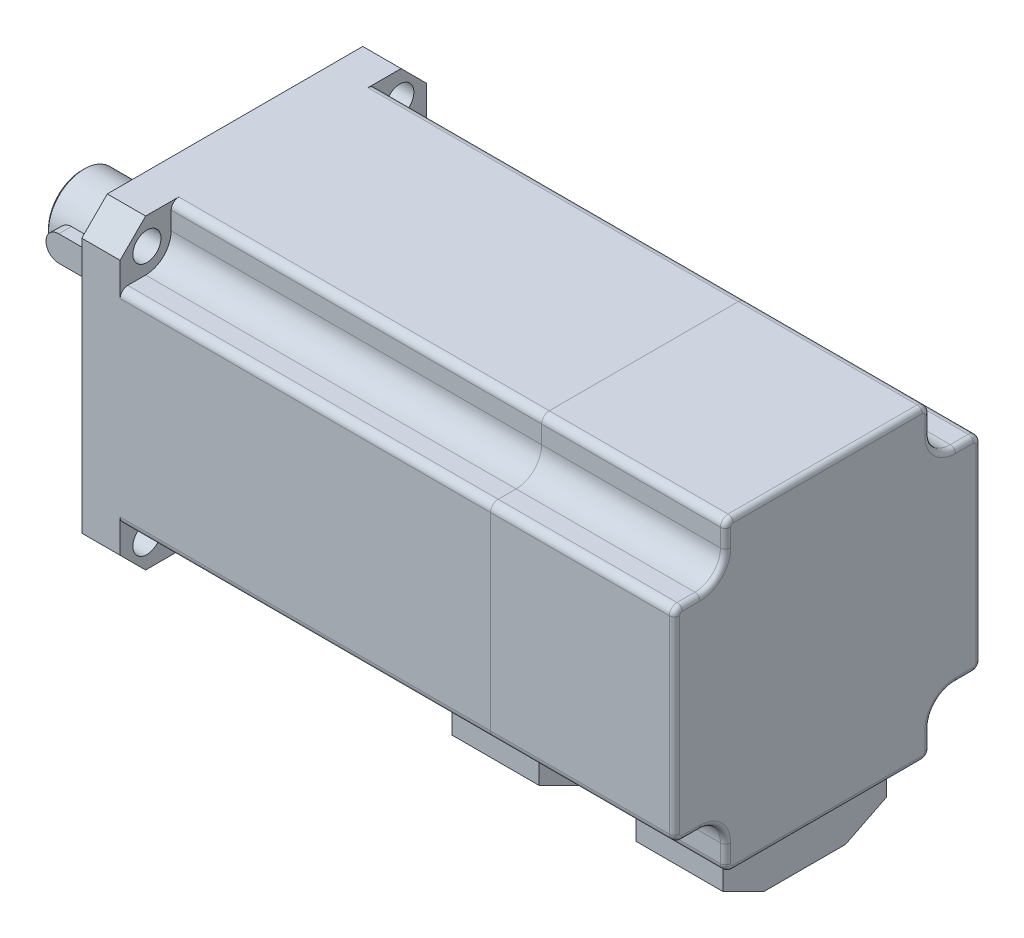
from build123d import *

# Parameters (mm, degrees)
EXTRUDE_1_DEPTH     = 80
EXTRUDE_2_DEPTH     = 36
CUT_EXTRUDE_1_DEPTH = 108.5
FILLET_1_R          = 1
SKETCH_4_R          = 2.75
CUT_EXTRUDE_2_DEPTH = 7.5
SKETCH_5_R          = 25
SKETCH_5_R_2        = 22.5
EXTRUDE_3_DEPTH     = 3
SKETCH_6_R          = 7.5
EXTRUDE_4_DEPTH     = 5
FILLET_2_R          = 0.5
SKETCH_7_R          = 7
EXTRUDE_5_DEPTH     = 25
CHAMFER_1_SIZE      = 0.5
CUT_EXTRUDE_3_DEPTH = 3
EXTRUDE_6_DEPTH     = 5
SKETCH_10_W         = 17
SKETCH_10_H         = 32
EXTRUDE_7_DEPTH     = 11
EXTRUDE_7_2_DEPTH   = 11
CUT_EXTRUDE_4_DEPTH = 53


with BuildPart() as part:
    # Sketch 1 → Extrude 1 (new body)
    with BuildSketch(Plane(origin=(0, 0, 0), x_dir=(0, 0, -1), z_dir=(1, 0, 0))):
        Polygon((-30, 25), (-25, 30), (25, 30), (30, 25), (30, -25), (25, -30), (-25, -30), (-30, -25), align=None)
    extrude(amount=EXTRUDE_1_DEPTH)


with BuildPart() as body_2:
    # Sketch 2 → Extrude 2 (new body)
    with BuildSketch(Plane(origin=(80, 0, 0), x_dir=(0, 0, -1), z_dir=(1, 0, 0))):
        Polygon((-25, -30), (25, -30), (30, -25), (30, 25), (25, 30), (-25, 30), (-30, 25), (-30, -25), align=None)
    extrude(amount=EXTRUDE_2_DEPTH)


with BuildPart() as cut_extrude_1_tool:
    # Sketch 3 → Cut-Extrude 1 (new body)
    with BuildSketch(Plane(origin=(116, 0, 0), x_dir=(0, 0, -1), z_dir=(1, 0, 0))):
        with BuildLine():
            Line((-25, 20), (-28.5, 20))
            ThreePointArc((-28.5, 20), (-29.560660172, 19.560660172), (-30, 18.5))
            Line((-30, 18.5), (-30, 25))
            Line((-30, 25), (-25, 30))
            Line((-25, 30), (-18.5, 30))
            ThreePointArc((-18.5, 30), (-19.560660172, 29.560660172), (-20, 28.5))
            Line((-20, 28.5), (-20, 25))
            ThreePointArc((-20, 25), (-21.464466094, 21.464466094), (-25, 20))
        make_face()
        with BuildLine():
            Line((18.5, 30), (25, 30))
            Line((25, 30), (30, 25))
            Line((30, 25), (30, 18.5))
            ThreePointArc((30, 18.5), (29.560660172, 19.560660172), (28.5, 20))
            Line((28.5, 20), (25, 20))
            ThreePointArc((25, 20), (21.464466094, 21.464466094), (20, 25))
            Line((20, 25), (20, 28.5))
            ThreePointArc((20, 28.5), (19.560660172, 29.560660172), (18.5, 30))
        make_face()
        with BuildLine():
            Line((-28.5, -20), (-25, -20))
            ThreePointArc((-25, -20), (-21.464466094, -21.464466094), (-20, -25))
            Line((-20, -25), (-20, -28.5))
            ThreePointArc((-20, -28.5), (-19.560660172, -29.560660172), (-18.5, -30))
            Line((-18.5, -30), (-25, -30))
            Line((-25, -30), (-30, -25))
            Line((-30, -25), (-30, -18.5))
            ThreePointArc((-30, -18.5), (-29.560660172, -19.560660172), (-28.5, -20))
        make_face()
        with BuildLine():
            Line((30, -18.5), (30, -25))
            Line((30, -25), (25, -30))
            Line((25, -30), (18.5, -30))
            ThreePointArc((18.5, -30), (19.560660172, -29.560660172), (20, -28.5))
            Line((20, -28.5), (20, -25))
            ThreePointArc((20, -25), (21.464466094, -21.464466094), (25, -20))
            Line((25, -20), (28.5, -20))
            ThreePointArc((28.5, -20), (29.560660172, -19.560660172), (30, -18.5))
        make_face()
    extrude(amount=-CUT_EXTRUDE_1_DEPTH)


with BuildPart() as part_1:
    add(part.part)

    # Cut-Extrude 1: cut by cut_extrude_1_tool
    add(cut_extrude_1_tool.part, mode=Mode.SUBTRACT)

    # Sketch 4 → Cut-Extrude 2 (cut)
    with BuildSketch(Plane.ZY):
        with Locations((-24.748737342, 24.748737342)):
            Circle(SKETCH_4_R)
        with Locations((24.748737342, 24.748737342)):
            Circle(SKETCH_4_R)
        with Locations((-24.748737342, -24.748737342)):
            Circle(SKETCH_4_R)
        with Locations((24.748737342, -24.748737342)):
            Circle(SKETCH_4_R)
    extrude(amount=-CUT_EXTRUDE_2_DEPTH, mode=Mode.SUBTRACT)



with BuildPart() as body_2_1:
    add(body_2.part)

    # Cut-Extrude 1: cut by cut_extrude_1_tool
    add(cut_extrude_1_tool.part, mode=Mode.SUBTRACT)

    # Fillet 1
    fillet_1_edges = [body_2_1.edges().sort_by_distance(p)[0] for p in [
        (116, 21.464466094, -21.464466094),
        (116, 20, -26.75),
        (116, 19.560660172, -29.560660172),
        (116, 29.560660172, -19.560660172),
        (116, 26.75, -20),
        (116, 0, 30),
        (116, -30, 0),
        (116, 0, -30),
        (116, 30, 0),
        (116, -19.560660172, 29.560660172),
        (116, -29.560660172, 19.560660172),
        (116, -26.75, 20),
        (116, -21.464466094, 21.464466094),
        (116, -20, 26.75),
        (116, 21.464466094, 21.464466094),
        (116, 26.75, 20),
        (116, 29.560660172, 19.560660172),
        (116, 19.560660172, 29.560660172),
        (116, 20, 26.75),
        (116, -21.464466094, -21.464466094),
        (116, -26.75, -20),
        (116, -29.560660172, -19.560660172),
        (116, -19.560660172, -29.560660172),
        (116, -20, -26.75),
    ]]
    fillet(fillet_1_edges, radius=FILLET_1_R)


with BuildPart() as body_3:
    # Sketch 5 → Extrude 3 (new body)
    with BuildSketch(Plane.ZY):
        Circle(SKETCH_5_R)
        Circle(SKETCH_5_R_2, mode=Mode.SUBTRACT)
    extrude(amount=EXTRUDE_3_DEPTH)


with BuildPart() as part_2:
    add(part_1.part)

    add(body_3.part)  # Extrude 4 merges body 3
    # Sketch 6 → Extrude 4 (add)
    with BuildSketch(Plane.ZY):
        Circle(SKETCH_6_R)
    extrude(amount=EXTRUDE_4_DEPTH)

    # Fillet 2
    fillet_2_edges = [part_2.edges().sort_by_distance(p)[0] for p in [
        (-5, 0, -7.5),
    ]]
    fillet(fillet_2_edges, radius=FILLET_2_R)

    # Sketch 7 → Extrude 5 (add)
    with BuildSketch(Plane.ZY.offset(5)):
        Circle(SKETCH_7_R)
    extrude(amount=EXTRUDE_5_DEPTH)

    # Chamfer 1
    chamfer_1_edges = [part_2.edges().sort_by_distance(p)[0] for p in [
        (-30, 0, -7),
    ]]
    chamfer(chamfer_1_edges, length=CHAMFER_1_SIZE)

    # Sketch 8 → Cut-Extrude 3 (cut)
    with BuildSketch(Plane.XY.offset(7)):
        with BuildLine():
            Line((-25.5, 2.5), (-10, 2.5))
            ThreePointArc((-10, 2.5), (-7.5, 0), (-10, -2.5))
            Line((-10, -2.5), (-25.5, -2.5))
            ThreePointArc((-25.5, -2.5), (-28, 0), (-25.5, 2.5))
        make_face()
    extrude(amount=-CUT_EXTRUDE_3_DEPTH, mode=Mode.SUBTRACT)


with BuildPart() as body_3_2:
    # Sketch 9 → Extrude 6 (new body)
    with BuildSketch(Plane.XY.offset(4)):
        with BuildLine():
            Line((-25.5, 2.5), (-10, 2.5))
            ThreePointArc((-10, 2.5), (-7.5, 0), (-10, -2.5))
            Line((-10, -2.5), (-25.5, -2.5))
            ThreePointArc((-25.5, -2.5), (-28, 0), (-25.5, 2.5))
        make_face()
    extrude(amount=EXTRUDE_6_DEPTH)


with BuildPart() as body_4:
    # Sketch 10 → Extrude 7 (new body)
    with BuildSketch(Plane(origin=(0, -30, 0), x_dir=(-1, 0, 0), z_dir=(0, -1, 0))):
        with Locations((-103, 0)):
            Rectangle(SKETCH_10_W, SKETCH_10_H)
    extrude(amount=EXTRUDE_7_DEPTH)


with BuildPart() as body_5:
    # Sketch 10 → Extrude 7 2 (new body)
    with BuildSketch(Plane(origin=(0, -30, 0), x_dir=(-1, 0, 0), z_dir=(0, -1, 0))):
        with Locations((-67, 0)):
            Rectangle(SKETCH_10_W, SKETCH_10_H)
    extrude(amount=EXTRUDE_7_2_DEPTH)


with BuildPart() as cut_extrude_4_tool:
    # Sketch 11 → Cut-Extrude 4 (new body)
    with BuildSketch(Plane.ZY.offset(-58.5)):
        Polygon((-16, -41), (-16, -37), (-8, -41), align=None)
        Polygon((16, -41), (16, -37), (8, -41), align=None)
    extrude(amount=-CUT_EXTRUDE_4_DEPTH)


with BuildPart() as body_4_1:
    add(body_4.part)

    # Cut-Extrude 4: cut by cut_extrude_4_tool
    add(cut_extrude_4_tool.part, mode=Mode.SUBTRACT)


with BuildPart() as body_5_1:
    add(body_5.part)

    # Cut-Extrude 4: cut by cut_extrude_4_tool
    add(cut_extrude_4_tool.part, mode=Mode.SUBTRACT)


solid = Compound([body_2_1.part, part_2.part, body_3_2.part, body_4_1.part, body_5_1.part])
